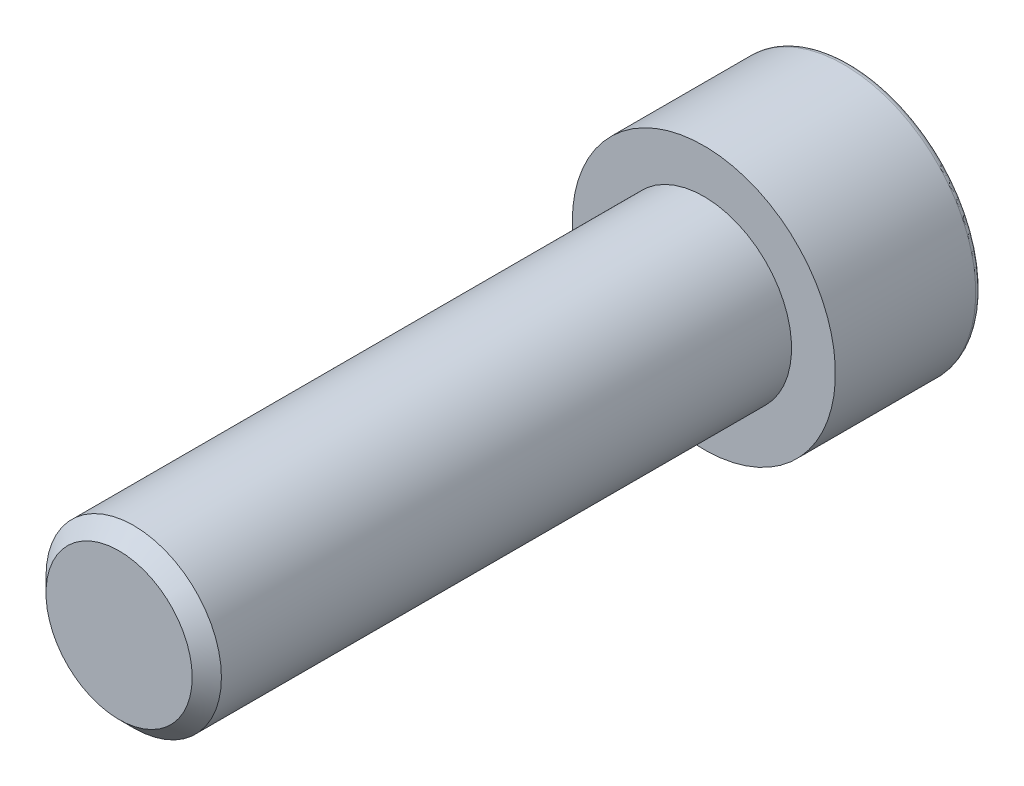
ISO-10303-21;
HEADER;
FILE_DESCRIPTION(('STEP AP214'),'2;1');
FILE_NAME('part.step','',(''),(''),'','','');
FILE_SCHEMA(('AUTOMOTIVE_DESIGN { 1 0 10303 214 1 1 1 1 }'));
ENDSEC;
DATA;
#1=APPLICATION_CONTEXT('core data for automotive mechanical design processes');
#2=APPLICATION_PROTOCOL_DEFINITION('international standard','automotive_design',2000,#1);
#3=PRODUCT_CONTEXT('',#1,'mechanical');
#4=PRODUCT('Part','Part','',(#3));
#5=PRODUCT_RELATED_PRODUCT_CATEGORY('part','',(#4));
#6=PRODUCT_DEFINITION_FORMATION('','',#4);
#7=PRODUCT_DEFINITION_CONTEXT('part definition',#1,'design');
#8=PRODUCT_DEFINITION('design','',#6,#7);
#9=PRODUCT_DEFINITION_SHAPE('','',#8);
#10=(LENGTH_UNIT() NAMED_UNIT(*) SI_UNIT(.MILLI.,.METRE.));
#11=(NAMED_UNIT(*) PLANE_ANGLE_UNIT() SI_UNIT($,.RADIAN.));
#12=(NAMED_UNIT(*) SI_UNIT($,.STERADIAN.) SOLID_ANGLE_UNIT());
#13=UNCERTAINTY_MEASURE_WITH_UNIT(LENGTH_MEASURE(1.E-05),#10,'distance_accuracy_value','');
#14=(GEOMETRIC_REPRESENTATION_CONTEXT(3) GLOBAL_UNCERTAINTY_ASSIGNED_CONTEXT((#13)) GLOBAL_UNIT_ASSIGNED_CONTEXT((#10,
#11,#12)) REPRESENTATION_CONTEXT('',''));
#15=CARTESIAN_POINT('',(0.,0.,0.));
#16=DIRECTION('',(0.,0.,1.));
#17=DIRECTION('',(1.,0.,0.));
#18=AXIS2_PLACEMENT_3D('',#15,#16,#17);
#19=CARTESIAN_POINT('',(0.,0.,20.));
#20=DIRECTION('',(0.,0.,-1.));
#21=DIRECTION('',(-1.,0.,0.));
#22=AXIS2_PLACEMENT_3D('',#19,#20,#21);
#23=CYLINDRICAL_SURFACE('',#22,3.);
#24=CARTESIAN_POINT('',(0.,0.,19.5));
#25=DIRECTION('',(0.,0.,1.));
#26=DIRECTION('',(1.,0.,0.));
#27=AXIS2_PLACEMENT_3D('',#24,#25,#26);
#28=CIRCLE('',#27,3.);
#29=CARTESIAN_POINT('',(3.,0.,19.5));
#30=VERTEX_POINT('',#29);
#31=EDGE_CURVE('E147',#30,#30,#28,.F.);
#32=ORIENTED_EDGE('',*,*,#31,.T.);
#33=EDGE_LOOP('',(#32));
#34=FACE_BOUND('',#33,.T.);
#35=CARTESIAN_POINT('',(0.,0.,0.));
#36=DIRECTION('',(0.,0.,-1.));
#37=DIRECTION('',(-1.,0.,0.));
#38=AXIS2_PLACEMENT_3D('',#35,#36,#37);
#39=CIRCLE('',#38,3.);
#40=CARTESIAN_POINT('',(-3.,0.,0.));
#41=VERTEX_POINT('',#40);
#42=EDGE_CURVE('E141',#41,#41,#39,.T.);
#43=ORIENTED_EDGE('',*,*,#42,.F.);
#44=EDGE_LOOP('',(#43));
#45=FACE_BOUND('',#44,.T.);
#46=ADVANCED_FACE('F31',(#34,#45),#23,.T.);
#47=CARTESIAN_POINT('',(0.,0.,20.));
#48=DIRECTION('',(0.,0.,1.));
#49=DIRECTION('',(1.,0.,0.));
#50=AXIS2_PLACEMENT_3D('',#47,#48,#49);
#51=PLANE('',#50);
#52=CARTESIAN_POINT('',(0.,0.,20.));
#53=DIRECTION('',(0.,0.,1.));
#54=DIRECTION('',(1.,0.,0.));
#55=AXIS2_PLACEMENT_3D('',#52,#53,#54);
#56=CIRCLE('',#55,2.5);
#57=CARTESIAN_POINT('',(2.5,0.,20.));
#58=VERTEX_POINT('',#57);
#59=EDGE_CURVE('E144',#58,#58,#56,.T.);
#60=ORIENTED_EDGE('',*,*,#59,.T.);
#61=EDGE_LOOP('',(#60));
#62=FACE_BOUND('',#61,.T.);
#63=ADVANCED_FACE('F164',(#62),#51,.T.);
#64=CARTESIAN_POINT('',(0.,0.,20.));
#65=DIRECTION('',(0.,0.,-1.));
#66=DIRECTION('',(-1.,0.,0.));
#67=AXIS2_PLACEMENT_3D('',#64,#65,#66);
#68=CONICAL_SURFACE('',#67,2.5,0.785398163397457);
#69=ORIENTED_EDGE('',*,*,#31,.F.);
#70=EDGE_LOOP('',(#69));
#71=FACE_BOUND('',#70,.T.);
#72=ORIENTED_EDGE('',*,*,#59,.F.);
#73=EDGE_LOOP('',(#72));
#74=FACE_BOUND('',#73,.T.);
#75=ADVANCED_FACE('F170',(#71,#74),#68,.T.);
#76=CARTESIAN_POINT('',(0.,0.,0.));
#77=DIRECTION('',(0.,0.,-1.));
#78=DIRECTION('',(-1.,0.,0.));
#79=AXIS2_PLACEMENT_3D('',#76,#77,#78);
#80=PLANE('',#79);
#81=CARTESIAN_POINT('',(0.,0.,0.));
#82=DIRECTION('',(0.,0.,-1.));
#83=DIRECTION('',(-1.,0.,0.));
#84=AXIS2_PLACEMENT_3D('',#81,#82,#83);
#85=CIRCLE('',#84,4.5);
#86=CARTESIAN_POINT('',(-4.5,0.,0.));
#87=VERTEX_POINT('',#86);
#88=EDGE_CURVE('E133',#87,#87,#85,.T.);
#89=ORIENTED_EDGE('',*,*,#88,.F.);
#90=EDGE_LOOP('',(#89));
#91=FACE_BOUND('',#90,.T.);
#92=ORIENTED_EDGE('',*,*,#42,.T.);
#93=EDGE_LOOP('',(#92));
#94=FACE_BOUND('',#93,.T.);
#95=ADVANCED_FACE('F176',(#91,#94),#80,.F.);
#96=CARTESIAN_POINT('',(0.,0.,-5.));
#97=DIRECTION('',(0.,0.,1.));
#98=DIRECTION('',(1.,0.,0.));
#99=AXIS2_PLACEMENT_3D('',#96,#97,#98);
#100=CYLINDRICAL_SURFACE('',#99,4.5);
#101=CARTESIAN_POINT('',(0.,0.,-4.8));
#102=DIRECTION('',(0.,0.,-1.));
#103=DIRECTION('',(-1.,0.,0.));
#104=AXIS2_PLACEMENT_3D('',#101,#102,#103);
#105=CIRCLE('',#104,4.5);
#106=CARTESIAN_POINT('',(-4.5,0.,-4.8));
#107=VERTEX_POINT('',#106);
#108=EDGE_CURVE('E11',#107,#107,#105,.F.);
#109=ORIENTED_EDGE('',*,*,#108,.T.);
#110=EDGE_LOOP('',(#109));
#111=FACE_BOUND('',#110,.T.);
#112=ORIENTED_EDGE('',*,*,#88,.T.);
#113=EDGE_LOOP('',(#112));
#114=FACE_BOUND('',#113,.T.);
#115=ADVANCED_FACE('F181',(#111,#114),#100,.T.);
#116=CARTESIAN_POINT('',(0.,0.,-5.));
#117=DIRECTION('',(0.,0.,-1.));
#118=DIRECTION('',(-1.,0.,0.));
#119=AXIS2_PLACEMENT_3D('',#116,#117,#118);
#120=PLANE('',#119);
#121=CARTESIAN_POINT('',(0.,0.,-5.));
#122=DIRECTION('',(0.,0.,-1.));
#123=DIRECTION('',(-1.,0.,0.));
#124=AXIS2_PLACEMENT_3D('',#121,#122,#123);
#125=CIRCLE('',#124,4.3);
#126=CARTESIAN_POINT('',(-4.3,0.,-5.));
#127=VERTEX_POINT('',#126);
#128=EDGE_CURVE('E39',#127,#127,#125,.T.);
#129=ORIENTED_EDGE('',*,*,#128,.T.);
#130=EDGE_LOOP('',(#129));
#131=FACE_BOUND('',#130,.T.);
#132=DIRECTION('',(-0.5,0.866025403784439,0.));
#133=VECTOR('',#132,1.);
#134=CARTESIAN_POINT('',(-1.35884072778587,-2.353581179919,-5.));
#135=LINE('',#134,#133);
#136=CARTESIAN_POINT('',(-1.35884072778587,-2.353581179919,-5.));
#137=VERTEX_POINT('',#136);
#138=CARTESIAN_POINT('',(-2.71768145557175,0.,-5.));
#139=VERTEX_POINT('',#138);
#140=EDGE_CURVE('E46',#137,#139,#135,.T.);
#141=ORIENTED_EDGE('',*,*,#140,.F.);
#142=DIRECTION('',(-1.,0.,0.));
#143=VECTOR('',#142,1.);
#144=CARTESIAN_POINT('',(1.35884072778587,-2.353581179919,-5.));
#145=LINE('',#144,#143);
#146=CARTESIAN_POINT('',(1.35884072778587,-2.353581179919,-5.));
#147=VERTEX_POINT('',#146);
#148=EDGE_CURVE('E129',#147,#137,#145,.T.);
#149=ORIENTED_EDGE('',*,*,#148,.F.);
#150=DIRECTION('',(-0.5,-0.866025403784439,0.));
#151=VECTOR('',#150,1.);
#152=CARTESIAN_POINT('',(2.71768145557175,0.,-5.));
#153=LINE('',#152,#151);
#154=CARTESIAN_POINT('',(2.71768145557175,0.,-5.));
#155=VERTEX_POINT('',#154);
#156=EDGE_CURVE('E127',#155,#147,#153,.T.);
#157=ORIENTED_EDGE('',*,*,#156,.F.);
#158=DIRECTION('',(0.5,-0.866025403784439,0.));
#159=VECTOR('',#158,1.);
#160=CARTESIAN_POINT('',(1.35884072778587,2.353581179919,-5.));
#161=LINE('',#160,#159);
#162=CARTESIAN_POINT('',(1.35884072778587,2.353581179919,-5.));
#163=VERTEX_POINT('',#162);
#164=EDGE_CURVE('E94',#163,#155,#161,.T.);
#165=ORIENTED_EDGE('',*,*,#164,.F.);
#166=DIRECTION('',(1.,0.,0.));
#167=VECTOR('',#166,1.);
#168=CARTESIAN_POINT('',(-1.35884072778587,2.353581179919,-5.));
#169=LINE('',#168,#167);
#170=CARTESIAN_POINT('',(-1.35884072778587,2.353581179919,-5.));
#171=VERTEX_POINT('',#170);
#172=EDGE_CURVE('E123',#171,#163,#169,.T.);
#173=ORIENTED_EDGE('',*,*,#172,.F.);
#174=DIRECTION('',(0.5,0.866025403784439,0.));
#175=VECTOR('',#174,1.);
#176=CARTESIAN_POINT('',(-2.71768145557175,0.,-5.));
#177=LINE('',#176,#175);
#178=EDGE_CURVE('E120',#139,#171,#177,.T.);
#179=ORIENTED_EDGE('',*,*,#178,.F.);
#180=EDGE_LOOP('',(#141,#149,#157,#165,#173,#179));
#181=FACE_BOUND('',#180,.T.);
#182=ADVANCED_FACE('F152',(#131,#181),#120,.T.);
#183=CARTESIAN_POINT('',(-1.35884072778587,-2.353581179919,-3.));
#184=DIRECTION('',(-0.866025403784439,-0.5,0.));
#185=DIRECTION('',(0.5,-0.866025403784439,0.));
#186=AXIS2_PLACEMENT_3D('',#183,#184,#185);
#187=PLANE('',#186);
#188=ORIENTED_EDGE('',*,*,#140,.T.);
#189=DIRECTION('',(0.,0.,-1.));
#190=VECTOR('',#189,1.);
#191=CARTESIAN_POINT('',(-2.71768145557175,0.,-3.));
#192=LINE('',#191,#190);
#193=CARTESIAN_POINT('',(-2.71768145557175,0.,-3.));
#194=VERTEX_POINT('',#193);
#195=EDGE_CURVE('E76',#194,#139,#192,.T.);
#196=ORIENTED_EDGE('',*,*,#195,.F.);
#197=DIRECTION('',(-0.5,0.866025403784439,0.));
#198=VECTOR('',#197,1.);
#199=CARTESIAN_POINT('',(-1.35884072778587,-2.353581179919,-3.));
#200=LINE('',#199,#198);
#201=CARTESIAN_POINT('',(-1.35884072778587,-2.353581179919,-3.));
#202=VERTEX_POINT('',#201);
#203=EDGE_CURVE('E131',#202,#194,#200,.T.);
#204=ORIENTED_EDGE('',*,*,#203,.F.);
#205=DIRECTION('',(0.,0.,-1.));
#206=VECTOR('',#205,1.);
#207=CARTESIAN_POINT('',(-1.35884072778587,-2.353581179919,-3.));
#208=LINE('',#207,#206);
#209=EDGE_CURVE('E54',#202,#137,#208,.T.);
#210=ORIENTED_EDGE('',*,*,#209,.T.);
#211=EDGE_LOOP('',(#188,#196,#204,#210));
#212=FACE_BOUND('',#211,.T.);
#213=ADVANCED_FACE('F196',(#212),#187,.F.);
#214=CARTESIAN_POINT('',(1.35884072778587,-2.353581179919,-3.));
#215=DIRECTION('',(0.,-1.,0.));
#216=DIRECTION('',(1.,0.,0.));
#217=AXIS2_PLACEMENT_3D('',#214,#215,#216);
#218=PLANE('',#217);
#219=ORIENTED_EDGE('',*,*,#148,.T.);
#220=ORIENTED_EDGE('',*,*,#209,.F.);
#221=DIRECTION('',(-1.,0.,0.));
#222=VECTOR('',#221,1.);
#223=CARTESIAN_POINT('',(1.35884072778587,-2.353581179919,-3.));
#224=LINE('',#223,#222);
#225=CARTESIAN_POINT('',(1.35884072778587,-2.353581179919,-3.));
#226=VERTEX_POINT('',#225);
#227=EDGE_CURVE('E106',#226,#202,#224,.T.);
#228=ORIENTED_EDGE('',*,*,#227,.F.);
#229=DIRECTION('',(0.,0.,-1.));
#230=VECTOR('',#229,1.);
#231=CARTESIAN_POINT('',(1.35884072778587,-2.353581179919,-3.));
#232=LINE('',#231,#230);
#233=EDGE_CURVE('E98',#226,#147,#232,.T.);
#234=ORIENTED_EDGE('',*,*,#233,.T.);
#235=EDGE_LOOP('',(#219,#220,#228,#234));
#236=FACE_BOUND('',#235,.T.);
#237=ADVANCED_FACE('F199',(#236),#218,.F.);
#238=CARTESIAN_POINT('',(2.71768145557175,0.,-3.));
#239=DIRECTION('',(0.866025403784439,-0.5,0.));
#240=DIRECTION('',(0.5,0.866025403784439,0.));
#241=AXIS2_PLACEMENT_3D('',#238,#239,#240);
#242=PLANE('',#241);
#243=ORIENTED_EDGE('',*,*,#156,.T.);
#244=ORIENTED_EDGE('',*,*,#233,.F.);
#245=DIRECTION('',(-0.5,-0.866025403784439,0.));
#246=VECTOR('',#245,1.);
#247=CARTESIAN_POINT('',(2.71768145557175,0.,-3.));
#248=LINE('',#247,#246);
#249=CARTESIAN_POINT('',(2.71768145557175,0.,-3.));
#250=VERTEX_POINT('',#249);
#251=EDGE_CURVE('E102',#250,#226,#248,.T.);
#252=ORIENTED_EDGE('',*,*,#251,.F.);
#253=DIRECTION('',(0.,0.,-1.));
#254=VECTOR('',#253,1.);
#255=CARTESIAN_POINT('',(2.71768145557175,0.,-3.));
#256=LINE('',#255,#254);
#257=EDGE_CURVE('E87',#250,#155,#256,.T.);
#258=ORIENTED_EDGE('',*,*,#257,.T.);
#259=EDGE_LOOP('',(#243,#244,#252,#258));
#260=FACE_BOUND('',#259,.T.);
#261=ADVANCED_FACE('F103',(#260),#242,.F.);
#262=CARTESIAN_POINT('',(1.35884072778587,2.353581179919,-3.));
#263=DIRECTION('',(0.866025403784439,0.5,0.));
#264=DIRECTION('',(-0.5,0.866025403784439,0.));
#265=AXIS2_PLACEMENT_3D('',#262,#263,#264);
#266=PLANE('',#265);
#267=ORIENTED_EDGE('',*,*,#164,.T.);
#268=ORIENTED_EDGE('',*,*,#257,.F.);
#269=DIRECTION('',(0.5,-0.866025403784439,0.));
#270=VECTOR('',#269,1.);
#271=CARTESIAN_POINT('',(1.35884072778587,2.353581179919,-3.));
#272=LINE('',#271,#270);
#273=CARTESIAN_POINT('',(1.35884072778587,2.353581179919,-3.));
#274=VERTEX_POINT('',#273);
#275=EDGE_CURVE('E91',#274,#250,#272,.T.);
#276=ORIENTED_EDGE('',*,*,#275,.F.);
#277=DIRECTION('',(0.,0.,-1.));
#278=VECTOR('',#277,1.);
#279=CARTESIAN_POINT('',(1.35884072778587,2.353581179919,-3.));
#280=LINE('',#279,#278);
#281=EDGE_CURVE('E99',#274,#163,#280,.T.);
#282=ORIENTED_EDGE('',*,*,#281,.T.);
#283=EDGE_LOOP('',(#267,#268,#276,#282));
#284=FACE_BOUND('',#283,.T.);
#285=ADVANCED_FACE('F89',(#284),#266,.F.);
#286=CARTESIAN_POINT('',(-1.35884072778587,2.353581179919,-3.));
#287=DIRECTION('',(0.,1.,0.));
#288=DIRECTION('',(0.,0.,1.));
#289=AXIS2_PLACEMENT_3D('',#286,#287,#288);
#290=PLANE('',#289);
#291=ORIENTED_EDGE('',*,*,#172,.T.);
#292=ORIENTED_EDGE('',*,*,#281,.F.);
#293=DIRECTION('',(1.,0.,0.));
#294=VECTOR('',#293,1.);
#295=CARTESIAN_POINT('',(-1.35884072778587,2.353581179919,-3.));
#296=LINE('',#295,#294);
#297=CARTESIAN_POINT('',(-1.35884072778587,2.353581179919,-3.));
#298=VERTEX_POINT('',#297);
#299=EDGE_CURVE('E112',#298,#274,#296,.T.);
#300=ORIENTED_EDGE('',*,*,#299,.F.);
#301=DIRECTION('',(0.,0.,-1.));
#302=VECTOR('',#301,1.);
#303=CARTESIAN_POINT('',(-1.35884072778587,2.353581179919,-3.));
#304=LINE('',#303,#302);
#305=EDGE_CURVE('E136',#298,#171,#304,.T.);
#306=ORIENTED_EDGE('',*,*,#305,.T.);
#307=EDGE_LOOP('',(#291,#292,#300,#306));
#308=FACE_BOUND('',#307,.T.);
#309=ADVANCED_FACE('F202',(#308),#290,.F.);
#310=CARTESIAN_POINT('',(-2.71768145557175,0.,-3.));
#311=DIRECTION('',(-0.866025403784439,0.5,0.));
#312=DIRECTION('',(-0.5,-0.866025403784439,0.));
#313=AXIS2_PLACEMENT_3D('',#310,#311,#312);
#314=PLANE('',#313);
#315=ORIENTED_EDGE('',*,*,#178,.T.);
#316=ORIENTED_EDGE('',*,*,#305,.F.);
#317=DIRECTION('',(0.5,0.866025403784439,0.));
#318=VECTOR('',#317,1.);
#319=CARTESIAN_POINT('',(-2.71768145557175,0.,-3.));
#320=LINE('',#319,#318);
#321=EDGE_CURVE('E114',#194,#298,#320,.T.);
#322=ORIENTED_EDGE('',*,*,#321,.F.);
#323=ORIENTED_EDGE('',*,*,#195,.T.);
#324=EDGE_LOOP('',(#315,#316,#322,#323));
#325=FACE_BOUND('',#324,.T.);
#326=ADVANCED_FACE('F160',(#325),#314,.F.);
#327=CARTESIAN_POINT('',(-2.71768145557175,0.,-3.));
#328=DIRECTION('',(0.,0.,-1.));
#329=DIRECTION('',(-1.,0.,0.));
#330=AXIS2_PLACEMENT_3D('',#327,#328,#329);
#331=PLANE('',#330);
#332=ORIENTED_EDGE('',*,*,#203,.T.);
#333=ORIENTED_EDGE('',*,*,#321,.T.);
#334=ORIENTED_EDGE('',*,*,#299,.T.);
#335=ORIENTED_EDGE('',*,*,#275,.T.);
#336=ORIENTED_EDGE('',*,*,#251,.T.);
#337=ORIENTED_EDGE('',*,*,#227,.T.);
#338=EDGE_LOOP('',(#332,#333,#334,#335,#336,#337));
#339=FACE_BOUND('',#338,.T.);
#340=ADVANCED_FACE('F109',(#339),#331,.T.);
#341=CARTESIAN_POINT('',(0.,0.,-4.8));
#342=DIRECTION('',(0.,0.,-1.));
#343=DIRECTION('',(-1.,0.,0.));
#344=AXIS2_PLACEMENT_3D('',#341,#342,#343);
#345=TOROIDAL_SURFACE('',#344,4.3,0.2);
#346=ORIENTED_EDGE('',*,*,#108,.F.);
#347=EDGE_LOOP('',(#346));
#348=FACE_BOUND('',#347,.T.);
#349=ORIENTED_EDGE('',*,*,#128,.F.);
#350=EDGE_LOOP('',(#349));
#351=FACE_BOUND('',#350,.T.);
#352=ADVANCED_FACE('F33',(#348,#351),#345,.T.);
#353=CLOSED_SHELL('',(#46,#63,#75,#95,#115,#182,#213,#237,#261,#285,#309,#326,#340,#352));
#354=MANIFOLD_SOLID_BREP('B2',#353);
#355=ADVANCED_BREP_SHAPE_REPRESENTATION('',(#18,#354),#14);
#356=SHAPE_DEFINITION_REPRESENTATION(#9,#355);
ENDSEC;
END-ISO-10303-21;
